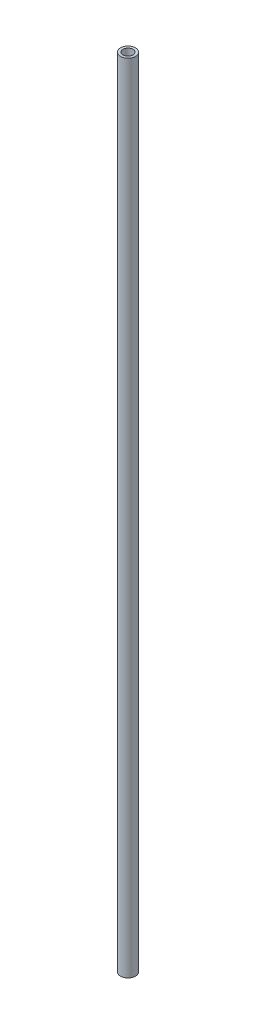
ISO-10303-21;
HEADER;
FILE_DESCRIPTION(('STEP AP214'),'2;1');
FILE_NAME('part.step','',(''),(''),'','','');
FILE_SCHEMA(('AUTOMOTIVE_DESIGN { 1 0 10303 214 1 1 1 1 }'));
ENDSEC;
DATA;
#1=APPLICATION_CONTEXT('core data for automotive mechanical design processes');
#2=APPLICATION_PROTOCOL_DEFINITION('international standard','automotive_design',2000,#1);
#3=PRODUCT_CONTEXT('',#1,'mechanical');
#4=PRODUCT('Part','Part','',(#3));
#5=PRODUCT_RELATED_PRODUCT_CATEGORY('part','',(#4));
#6=PRODUCT_DEFINITION_FORMATION('','',#4);
#7=PRODUCT_DEFINITION_CONTEXT('part definition',#1,'design');
#8=PRODUCT_DEFINITION('design','',#6,#7);
#9=PRODUCT_DEFINITION_SHAPE('','',#8);
#10=(LENGTH_UNIT() NAMED_UNIT(*) SI_UNIT(.MILLI.,.METRE.));
#11=(NAMED_UNIT(*) PLANE_ANGLE_UNIT() SI_UNIT($,.RADIAN.));
#12=(NAMED_UNIT(*) SI_UNIT($,.STERADIAN.) SOLID_ANGLE_UNIT());
#13=UNCERTAINTY_MEASURE_WITH_UNIT(LENGTH_MEASURE(1.E-05),#10,'distance_accuracy_value','');
#14=(GEOMETRIC_REPRESENTATION_CONTEXT(3) GLOBAL_UNCERTAINTY_ASSIGNED_CONTEXT((#13)) GLOBAL_UNIT_ASSIGNED_CONTEXT((#10,
#11,#12)) REPRESENTATION_CONTEXT('',''));
#15=CARTESIAN_POINT('',(0.,0.,0.));
#16=DIRECTION('',(0.,0.,1.));
#17=DIRECTION('',(1.,0.,0.));
#18=AXIS2_PLACEMENT_3D('',#15,#16,#17);
#19=CARTESIAN_POINT('',(0.,160.,0.));
#20=DIRECTION('',(0.,1.,0.));
#21=DIRECTION('',(0.,0.,1.));
#22=AXIS2_PLACEMENT_3D('',#19,#20,#21);
#23=PLANE('',#22);
#24=CARTESIAN_POINT('',(0.,160.,0.));
#25=DIRECTION('',(0.,1.,0.));
#26=DIRECTION('',(0.,0.,1.));
#27=AXIS2_PLACEMENT_3D('',#24,#25,#26);
#28=CIRCLE('',#27,1.5);
#29=CARTESIAN_POINT('',(0.,160.,1.5));
#30=VERTEX_POINT('',#29);
#31=EDGE_CURVE('E10',#30,#30,#28,.T.);
#32=ORIENTED_EDGE('',*,*,#31,.T.);
#33=EDGE_LOOP('',(#32));
#34=FACE_BOUND('',#33,.T.);
#35=CARTESIAN_POINT('',(0.,160.,0.));
#36=DIRECTION('',(0.,1.,0.));
#37=DIRECTION('',(0.,0.,1.));
#38=AXIS2_PLACEMENT_3D('',#35,#36,#37);
#39=CIRCLE('',#38,1.);
#40=CARTESIAN_POINT('',(0.,160.,1.));
#41=VERTEX_POINT('',#40);
#42=EDGE_CURVE('E42',#41,#41,#39,.T.);
#43=ORIENTED_EDGE('',*,*,#42,.F.);
#44=EDGE_LOOP('',(#43));
#45=FACE_BOUND('',#44,.T.);
#46=ADVANCED_FACE('F31',(#34,#45),#23,.T.);
#47=CARTESIAN_POINT('',(0.,0.,0.));
#48=DIRECTION('',(0.,1.,0.));
#49=DIRECTION('',(0.,0.,1.));
#50=AXIS2_PLACEMENT_3D('',#47,#48,#49);
#51=PLANE('',#50);
#52=CARTESIAN_POINT('',(0.,0.,0.));
#53=DIRECTION('',(0.,1.,0.));
#54=DIRECTION('',(0.,0.,1.));
#55=AXIS2_PLACEMENT_3D('',#52,#53,#54);
#56=CIRCLE('',#55,1.5);
#57=CARTESIAN_POINT('',(0.,0.,1.5));
#58=VERTEX_POINT('',#57);
#59=EDGE_CURVE('E35',#58,#58,#56,.T.);
#60=ORIENTED_EDGE('',*,*,#59,.F.);
#61=EDGE_LOOP('',(#60));
#62=FACE_BOUND('',#61,.T.);
#63=CARTESIAN_POINT('',(0.,0.,0.));
#64=DIRECTION('',(0.,1.,0.));
#65=DIRECTION('',(0.,0.,1.));
#66=AXIS2_PLACEMENT_3D('',#63,#64,#65);
#67=CIRCLE('',#66,1.);
#68=CARTESIAN_POINT('',(0.,0.,1.));
#69=VERTEX_POINT('',#68);
#70=EDGE_CURVE('E44',#69,#69,#67,.T.);
#71=ORIENTED_EDGE('',*,*,#70,.T.);
#72=EDGE_LOOP('',(#71));
#73=FACE_BOUND('',#72,.T.);
#74=ADVANCED_FACE('F54',(#62,#73),#51,.F.);
#75=CARTESIAN_POINT('',(0.,160.,0.));
#76=DIRECTION('',(0.,-1.,0.));
#77=DIRECTION('',(0.,0.,-1.));
#78=AXIS2_PLACEMENT_3D('',#75,#76,#77);
#79=CYLINDRICAL_SURFACE('',#78,1.5);
#80=ORIENTED_EDGE('',*,*,#31,.F.);
#81=EDGE_LOOP('',(#80));
#82=FACE_BOUND('',#81,.T.);
#83=ORIENTED_EDGE('',*,*,#59,.T.);
#84=EDGE_LOOP('',(#83));
#85=FACE_BOUND('',#84,.T.);
#86=ADVANCED_FACE('F33',(#82,#85),#79,.T.);
#87=CARTESIAN_POINT('',(0.,160.,0.));
#88=DIRECTION('',(0.,-1.,0.));
#89=DIRECTION('',(0.,0.,-1.));
#90=AXIS2_PLACEMENT_3D('',#87,#88,#89);
#91=CYLINDRICAL_SURFACE('',#90,1.);
#92=ORIENTED_EDGE('',*,*,#42,.T.);
#93=EDGE_LOOP('',(#92));
#94=FACE_BOUND('',#93,.T.);
#95=ORIENTED_EDGE('',*,*,#70,.F.);
#96=EDGE_LOOP('',(#95));
#97=FACE_BOUND('',#96,.T.);
#98=ADVANCED_FACE('F50',(#94,#97),#91,.F.);
#99=CLOSED_SHELL('',(#46,#74,#86,#98));
#100=MANIFOLD_SOLID_BREP('B2',#99);
#101=ADVANCED_BREP_SHAPE_REPRESENTATION('',(#18,#100),#14);
#102=SHAPE_DEFINITION_REPRESENTATION(#9,#101);
ENDSEC;
END-ISO-10303-21;
